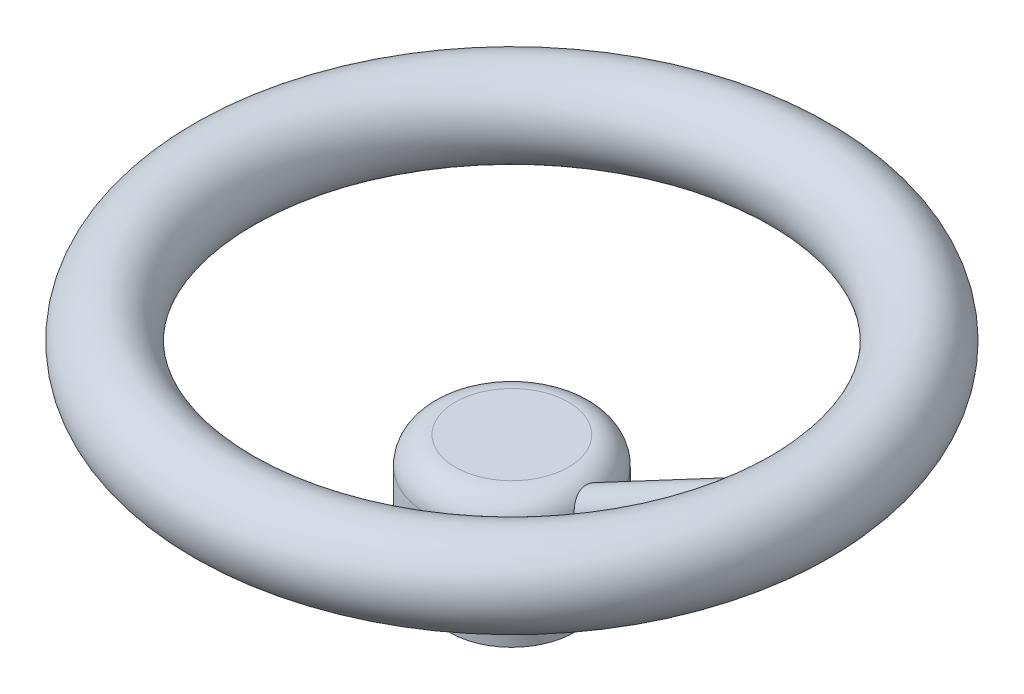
from build123d import *

# Parameters (mm, degrees)
SKETCH1_R                      = 8.734980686
BOSS_EXTRUDE2_REACH            = 104.166
BOSS_EXTRUDE2_END_MAJOR_RADIUS = 60.445848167
BOSS_EXTRUDE2_END_MINOR_RADIUS = 8.734980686
SKETCH2_R                      = 3.98072673


with BuildPart() as part:
    # Sketch1 → Revolve1 (revolve)
    with BuildSketch(Plane.XY, mode=Mode.PRIVATE) as revolve1_sk:
        with Locations((60.445848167, 17.075098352)):
            Circle(SKETCH1_R)
        with BuildLine():
            Line((0, 0), (11.862125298, 0))
            ThreePointArc((11.862125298, 0), (15.908862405, -1.676213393), (17.585075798, -5.7229505))
            Line((17.585075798, -5.7229505), (17.585075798, -12.382969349))
            Line((17.585075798, -12.382969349), (13.062097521, -12.382969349))
            Line((13.062097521, -12.382969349), (13.062097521, -29.427049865))
            Line((13.062097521, -29.427049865), (0, -29.427049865))
            Line((0, -29.427049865), (0, 0))
        make_face()
    revolve(revolve1_sk.sketch.rotate(Axis((0, 0, 0), (0, -1, 0)), 180), axis=Axis((0, 0, 0), (0, -1, 0)))

    # Boss-Extrude2: up to this torus (the profile starts outside it)
    boss_extrude2_end = Plane(origin=(0, 17.075098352, 0), z_dir=(0, 1, 0)) * Torus(BOSS_EXTRUDE2_END_MAJOR_RADIUS, BOSS_EXTRUDE2_END_MINOR_RADIUS, mode=Mode.PRIVATE)
    # Sketch2 → Boss-Extrude2 (add, up to the surface)
    with BuildSketch(Plane(origin=(0, 0, 0), x_dir=(-0.46947156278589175, 0.8829475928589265, 0), z_dir=(0.8829475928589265, 0.46947156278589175, 0)), mode=Mode.PRIVATE) as boss_extrude2_sk1:
        with Locations(Location((-12.492227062, 0, 0), (0, 0, 243.706244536))):
            Circle(SKETCH2_R)
    boss_extrude2_tool1 = extrude(boss_extrude2_sk1.sketch, amount=BOSS_EXTRUDE2_REACH, mode=Mode.PRIVATE) - boss_extrude2_end
    add(boss_extrude2_tool1.solids().sort_by_distance((5.864745, -11.029982, 0))[0])


solid = part.part
